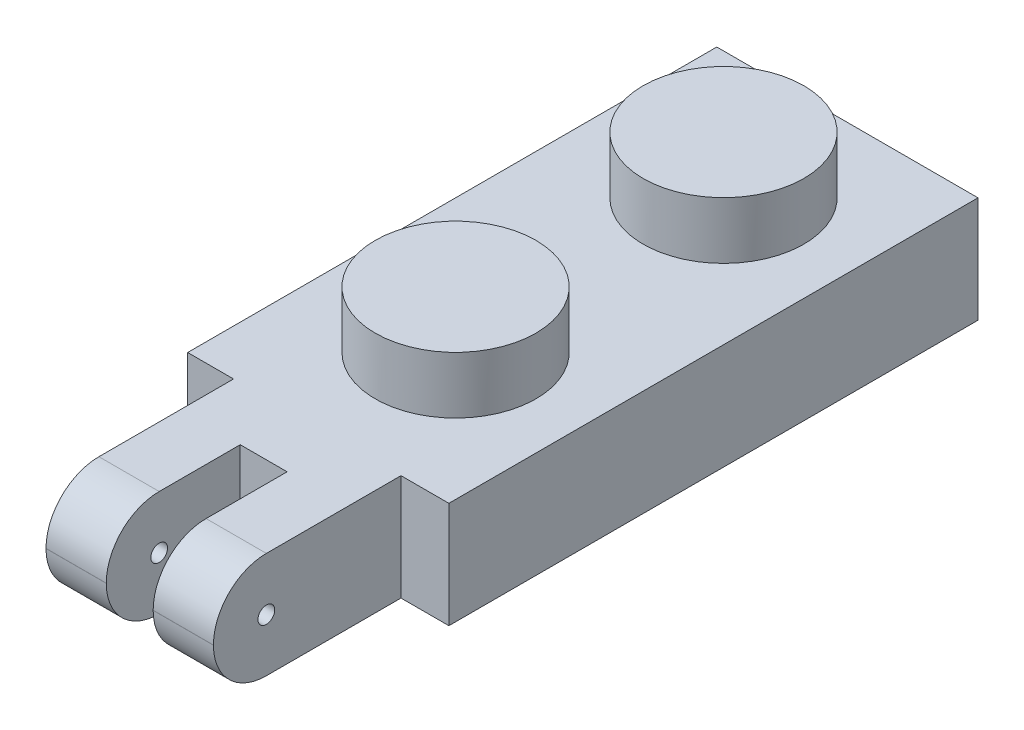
from build123d import *

# Parameters (mm, degrees)
SKETCH1_W           = 7.8
SKETCH1_H           = 15.8
EXTRUDE1_DEPTH      = 3.166
SKETCH2_R           = 2.4
EXTRUDE2_DEPTH      = 1.7
SKETCH3_W           = 4.9
SKETCH3_H           = 4.9
EXTRUDE3_DEPTH      = 2.5
LPATTERN1_COUNT     = 2
LPATTERN1_PITCH     = 8
LPATTERN2_COUNT     = 2
LPATTERN2_PITCH     = 8
SKETCH5_W           = 5
SKETCH5_H           = 3.166
BOSS_EXTRUDE1_DEPTH = 5.6
SKETCH6_W           = 1.4
SKETCH6_H           = 3.166
CUT_EXTRUDE1_DEPTH  = 4
FILLET2_R           = 1.58
SKETCH7_R           = 0.25
CUT_EXTRUDE2_DEPTH  = 18.73873885


with BuildPart() as part:
    # Sketch1 → Extrude1 (new body)
    with BuildSketch(Plane(origin=(0, 0, 0), x_dir=(1, 0, 0), z_dir=(0, 1, 0))):
        with Locations((3.9, 7.9)):
            Rectangle(SKETCH1_W, SKETCH1_H)
    extrude(amount=EXTRUDE1_DEPTH)

    # Sketch2 → Extrude2 (add)
    with BuildSketch(Plane(origin=(0, 3.166, 0), x_dir=(1, 0, 0), z_dir=(0, 1, 0))):
        with Locations(Location((4, 4, 0), (0, 0, 90))):
            Circle(SKETCH2_R)
    extrude2 = extrude(amount=EXTRUDE2_DEPTH)

    # Sketch3 → Extrude3 (cut)
    with BuildSketch(Plane.XZ):
        with Locations((3.9, -11.9)):
            Rectangle(SKETCH3_W, SKETCH3_H)
    extrude3 = extrude(amount=-EXTRUDE3_DEPTH, mode=Mode.SUBTRACT)

    # LPattern1: Extrude2 ×2
    with Locations(*[(0, 0, -i * LPATTERN1_PITCH) for i in range(1, LPATTERN1_COUNT)]):
        add(extrude2)

    # LPattern2: Extrude3 ×2
    with Locations(*[(0, 0, i * LPATTERN2_PITCH) for i in range(1, LPATTERN2_COUNT)]):
        add(extrude3, mode=Mode.SUBTRACT)

    # Sketch5 → Boss-Extrude1 (add)
    with BuildSketch(Plane.XY):
        with Locations((3.87, 1.583)):
            Rectangle(SKETCH5_W, SKETCH5_H)
    extrude(amount=BOSS_EXTRUDE1_DEPTH)

    # Sketch6 → Cut-Extrude1 (cut)
    with BuildSketch(Plane.XY.offset(5.6)):
        with Locations((3.87, 1.583)):
            Rectangle(SKETCH6_W, SKETCH6_H)
    extrude(amount=-CUT_EXTRUDE1_DEPTH, mode=Mode.SUBTRACT)

    # Fillet2
    fillet2_edges = [part.edges().sort_by_distance(p)[0] for p in [
        (2.27, 0, 5.6),
        (5.47, 0, 5.6),
        (5.47, 3.166, 5.6),
        (2.27, 3.166, 5.6),
    ]]
    fillet(fillet2_edges, radius=FILLET2_R)

    # Sketch7 → Cut-Extrude2 (cut, through all)
    with BuildSketch(Plane.ZY.offset(-1.37)):
        with Locations(Location((4.02, 1.58, 0), (0, 0, 180))):
            Circle(SKETCH7_R)
    extrude(amount=-CUT_EXTRUDE2_DEPTH, mode=Mode.SUBTRACT)


solid = part.part
